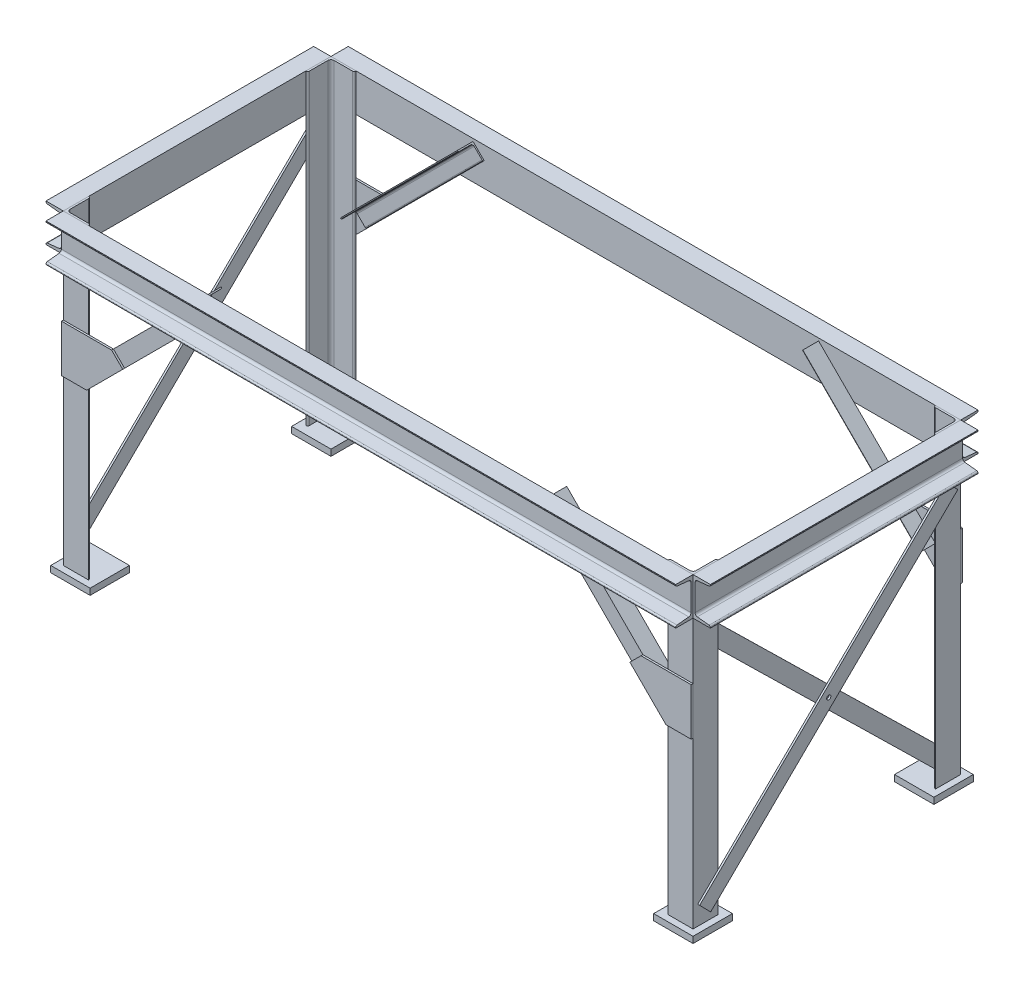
from build123d import *

# Parameters (mm, degrees)
C_CHANNEL_CH_120_X_12_1_DEPTH   = 2000
C_CHANNEL_CH_120_X_12_1_2_DEPTH = 850
C_CHANNEL_CH_120_X_12_1_3_DEPTH = 2000
C_CHANNEL_CH_120_X_12_1_4_DEPTH = 850
L_ANGLE_EQUAL_80X80X6_2_DEPTH   = 975
REINFORCING_PLATE_DEPTH         = 6
L_ANGLE_EQUAL_50X50X4_1_DEPTH   = 525
SKETCH15_W                      = 125
SKETCH15_H                      = 125
FOOT_PLATE_DEPTH                = 20
CROSS_BRACE_1_DEPTH             = 6
CROSS_BRACE_2_DEPTH             = 6
SKETCH19_W                      = 6.75
SKETCH19_H                      = 2061


with BuildPart() as part:
    # Sketch1 → C channel CH 120 X 12_1 (new body)
    with BuildSketch(Plane(origin=(1000, 880, 425), x_dir=(0, 0, 1), z_dir=(-1, 0, 0))):
        with BuildLine():
            Line((55, 120), (0, 120))
            Line((0, 120), (0, 0))
            Line((0, 0), (55, 0))
            Line((55, 0), (55, 1.888893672))
            ThreePointArc((55, 1.888893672), (53.844151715, 4.899981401), (50.970378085, 6.364242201))
            Line((50.970378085, 6.364242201), (13.463772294, 10.30634532))
            ThreePointArc((13.463772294, 10.30634532), (8.354841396, 12.909475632), (6.3, 18.262520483))
            Line((6.3, 18.262520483), (6.3, 101.737479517))
            ThreePointArc((6.3, 101.737479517), (8.354841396, 107.090524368), (13.463772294, 109.69365468))
            Line((13.463772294, 109.69365468), (50.970378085, 113.635757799))
            ThreePointArc((50.970378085, 113.635757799), (53.844151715, 115.100018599), (55, 118.111106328))
            Line((55, 118.111106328), (55, 120))
        make_face()
    extrude(amount=C_CHANNEL_CH_120_X_12_1_DEPTH)


with BuildPart() as body_2:
    # Sketch1 on segment 2 (on carried to segment 2) → C channel CH 120 X 12_1 2 (new body)
    with BuildSketch(Plane(origin=(-1000, 880, 425), x_dir=(-1, 0, 0), z_dir=(0, 0, -1))):
        with BuildLine():
            Line((55, 120), (0, 120))
            Line((0, 120), (0, 0))
            Line((0, 0), (55, 0))
            Line((55, 0), (55, 1.888893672))
            ThreePointArc((55, 1.888893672), (53.844151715, 4.899981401), (50.970378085, 6.364242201))
            Line((50.970378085, 6.364242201), (13.463772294, 10.30634532))
            ThreePointArc((13.463772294, 10.30634532), (8.354841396, 12.909475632), (6.3, 18.262520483))
            Line((6.3, 18.262520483), (6.3, 101.737479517))
            ThreePointArc((6.3, 101.737479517), (8.354841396, 107.090524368), (13.463772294, 109.69365468))
            Line((13.463772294, 109.69365468), (50.970378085, 113.635757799))
            ThreePointArc((50.970378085, 113.635757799), (53.844151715, 115.100018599), (55, 118.111106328))
            Line((55, 118.111106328), (55, 120))
        make_face()
    extrude(amount=C_CHANNEL_CH_120_X_12_1_2_DEPTH)


with BuildPart() as body_3:
    # Sketch1 on segment 3 (on carried to segment 3) → C channel CH 120 X 12_1 3 (new body)
    with BuildSketch(Plane(origin=(-1000, 880, -425), x_dir=(0, 0, -1), z_dir=(1, 0, 0))):
        with BuildLine():
            Line((55, 120), (0, 120))
            Line((0, 120), (0, 0))
            Line((0, 0), (55, 0))
            Line((55, 0), (55, 1.888893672))
            ThreePointArc((55, 1.888893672), (53.844151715, 4.899981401), (50.970378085, 6.364242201))
            Line((50.970378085, 6.364242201), (13.463772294, 10.30634532))
            ThreePointArc((13.463772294, 10.30634532), (8.354841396, 12.909475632), (6.3, 18.262520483))
            Line((6.3, 18.262520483), (6.3, 101.737479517))
            ThreePointArc((6.3, 101.737479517), (8.354841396, 107.090524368), (13.463772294, 109.69365468))
            Line((13.463772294, 109.69365468), (50.970378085, 113.635757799))
            ThreePointArc((50.970378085, 113.635757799), (53.844151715, 115.100018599), (55, 118.111106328))
            Line((55, 118.111106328), (55, 120))
        make_face()
    extrude(amount=C_CHANNEL_CH_120_X_12_1_3_DEPTH)


with BuildPart() as body_4:
    # Sketch1 on segment 4 (on carried to segment 4) → C channel CH 120 X 12_1 4 (new body)
    with BuildSketch(Plane(origin=(1000, 880, -425), x_dir=(1, 0, 0), z_dir=(0, 0, 1))):
        with BuildLine():
            Line((55, 120), (0, 120))
            Line((0, 120), (0, 0))
            Line((0, 0), (55, 0))
            Line((55, 0), (55, 1.888893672))
            ThreePointArc((55, 1.888893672), (53.844151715, 4.899981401), (50.970378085, 6.364242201))
            Line((50.970378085, 6.364242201), (13.463772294, 10.30634532))
            ThreePointArc((13.463772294, 10.30634532), (8.354841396, 12.909475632), (6.3, 18.262520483))
            Line((6.3, 18.262520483), (6.3, 101.737479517))
            ThreePointArc((6.3, 101.737479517), (8.354841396, 107.090524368), (13.463772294, 109.69365468))
            Line((13.463772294, 109.69365468), (50.970378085, 113.635757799))
            ThreePointArc((50.970378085, 113.635757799), (53.844151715, 115.100018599), (55, 118.111106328))
            Line((55, 118.111106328), (55, 120))
        make_face()
    extrude(amount=C_CHANNEL_CH_120_X_12_1_4_DEPTH)


with BuildPart() as body_5:
    # Sketch11 → L angle _equal_ 80X80X6_2 (new body)
    with BuildSketch(Plane(origin=(-1000, 1000, 425), x_dir=(0, 0, -1), z_dir=(0, -1, 0))):
        with BuildLine():
            Line((0, 80), (0, 0))
            Line((0, 0), (80, 0))
            ThreePointArc((80, 0), (78.242640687, 4.242640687), (74, 6))
            Line((74, 6), (16, 6))
            ThreePointArc((16, 6), (8.928932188, 8.928932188), (6, 16))
            Line((6, 16), (6, 74))
            ThreePointArc((6, 74), (4.242640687, 78.242640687), (0, 80))
        make_face()
    extrude(amount=L_ANGLE_EQUAL_80X80X6_2_DEPTH)


with BuildPart() as body_6:
    # Sketch12 → Reinforcing Plate (new body)
    with BuildSketch(Plane.XY.offset(425)):
        Polygon((-1000, 700), (-1000, 550), (-920, 550), (-805.355339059, 664.644660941), (-840.710678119, 700), align=None)
    extrude(amount=REINFORCING_PLATE_DEPTH)


with BuildPart() as body_7:
    # Sketch14 → L angle _equal_ 50X50X4_1 (new body)
    with BuildSketch(Plane(origin=(-548.768939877, 991.941738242, 425), x_dir=(0, 0, -1), z_dir=(-0.7071067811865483, -0.7071067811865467, 0))):
        with BuildLine():
            Line((0, 50), (0, 0))
            Line((0, 0), (50, 0))
            ThreePointArc((50, 0), (48.828427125, 2.828427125), (46, 4))
            Line((46, 4), (11, 4))
            ThreePointArc((11, 4), (6.050252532, 6.050252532), (4, 11))
            Line((4, 11), (4, 46))
            ThreePointArc((4, 46), (2.828427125, 48.828427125), (0, 50))
        make_face()
    extrude(amount=L_ANGLE_EQUAL_50X50X4_1_DEPTH)


with BuildPart() as body_8:
    # Sketch15 → Foot Plate (new body)
    with BuildSketch(Plane.XZ.offset(-25)):
        with Locations((-957.5, 382.5)):
            Rectangle(SKETCH15_W, SKETCH15_H)
    extrude(amount=FOOT_PLATE_DEPTH)


with BuildPart() as body_9:
    # Mirror1: mirrored copy
    add(body_8.part.mirror(Plane.XY))


with BuildPart() as body_10:
    # Mirror1 2: mirrored copy
    add(body_5.part.mirror(Plane.XY))


with BuildPart() as body_11:
    # Mirror1 3: mirrored copy
    add(body_6.part.mirror(Plane.XY))


with BuildPart() as body_12:
    # Mirror1 4: mirrored copy
    add(body_7.part.mirror(Plane.XY))


with BuildPart() as body_13:
    # Sketch16 → Cross Brace 1 (new body)
    with BuildSketch(Plane.ZY.offset(1000)):
        Polygon((-410, 819.28902113), (375.003914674, 50), (410, 85.71097887), (-375.003914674, 855), align=None)
    extrude(amount=CROSS_BRACE_1_DEPTH)


with BuildPart() as body_14:
    # Sketch17 → Cross Brace 2 (new body)
    with BuildSketch(Plane(origin=(-994, 0, 0), x_dir=(0, 0, -1), z_dir=(1, 0, 0))):
        Polygon((-410, 819.28902113), (375.003914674, 50), (410, 85.71097887), (-375.003914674, 855), align=None)
    extrude(amount=CROSS_BRACE_2_DEPTH)


with BuildPart() as m12_clearance_hole1_tool:
    # Sketch19 → M12 Clearance Hole1 (revolve)
    with BuildSketch(Plane(origin=(-1006, 452.5, 0), x_dir=(0, 0, 1), z_dir=(0, 1, 0))):
        with Locations((3.375, 1030.5)):
            Rectangle(SKETCH19_W, SKETCH19_H)
    revolve(axis=Axis((-1012.35, 452.5, 0), (1, 0, 0)))


with BuildPart() as body_13_1:
    add(body_13.part)

    # M12 Clearance Hole1: cut by m12_clearance_hole1_tool
    add(m12_clearance_hole1_tool.part, mode=Mode.SUBTRACT)


with BuildPart() as body_14_1:
    add(body_14.part)

    # M12 Clearance Hole1: cut by m12_clearance_hole1_tool
    add(m12_clearance_hole1_tool.part, mode=Mode.SUBTRACT)


with BuildPart() as body_15:
    # Mirror2: mirrored copy
    add(body_8.part.mirror(Plane(origin=(0, 0, 0), x_dir=(0, 0, 1), z_dir=(1, 0, 0))))


with BuildPart() as body_16:
    # Mirror2 2: mirrored copy
    add(body_5.part.mirror(Plane(origin=(0, 0, 0), x_dir=(0, 0, 1), z_dir=(1, 0, 0))))


with BuildPart() as body_17:
    # Mirror2 3: mirrored copy
    add(body_6.part.mirror(Plane(origin=(0, 0, 0), x_dir=(0, 0, 1), z_dir=(1, 0, 0))))


with BuildPart() as body_18:
    # Mirror2 4: mirrored copy
    add(body_7.part.mirror(Plane(origin=(0, 0, 0), x_dir=(0, 0, 1), z_dir=(1, 0, 0))))


with BuildPart() as body_19:
    # Mirror2 5: mirrored copy
    add(body_9.part.mirror(Plane(origin=(0, 0, 0), x_dir=(0, 0, 1), z_dir=(1, 0, 0))))


with BuildPart() as body_20:
    # Mirror2 6: mirrored copy
    add(body_10.part.mirror(Plane(origin=(0, 0, 0), x_dir=(0, 0, 1), z_dir=(1, 0, 0))))


with BuildPart() as body_21:
    # Mirror2 7: mirrored copy
    add(body_11.part.mirror(Plane(origin=(0, 0, 0), x_dir=(0, 0, 1), z_dir=(1, 0, 0))))


with BuildPart() as body_22:
    # Mirror2 8: mirrored copy
    add(body_12.part.mirror(Plane(origin=(0, 0, 0), x_dir=(0, 0, 1), z_dir=(1, 0, 0))))


with BuildPart() as body_23:
    # Mirror2 9: mirrored copy
    add(body_14_1.part.mirror(Plane(origin=(0, 0, 0), x_dir=(0, 0, 1), z_dir=(1, 0, 0))))


with BuildPart() as body_24:
    # Mirror2 10: mirrored copy
    add(body_13_1.part.mirror(Plane(origin=(0, 0, 0), x_dir=(0, 0, 1), z_dir=(1, 0, 0))))


solid = Compound([part.part, body_2.part, body_3.part, body_4.part, body_5.part, body_6.part, body_7.part, body_8.part, body_9.part, body_10.part, body_11.part, body_12.part, body_13_1.part, body_14_1.part, body_15.part, body_16.part, body_17.part, body_18.part, body_19.part, body_20.part, body_21.part, body_22.part, body_23.part, body_24.part])
